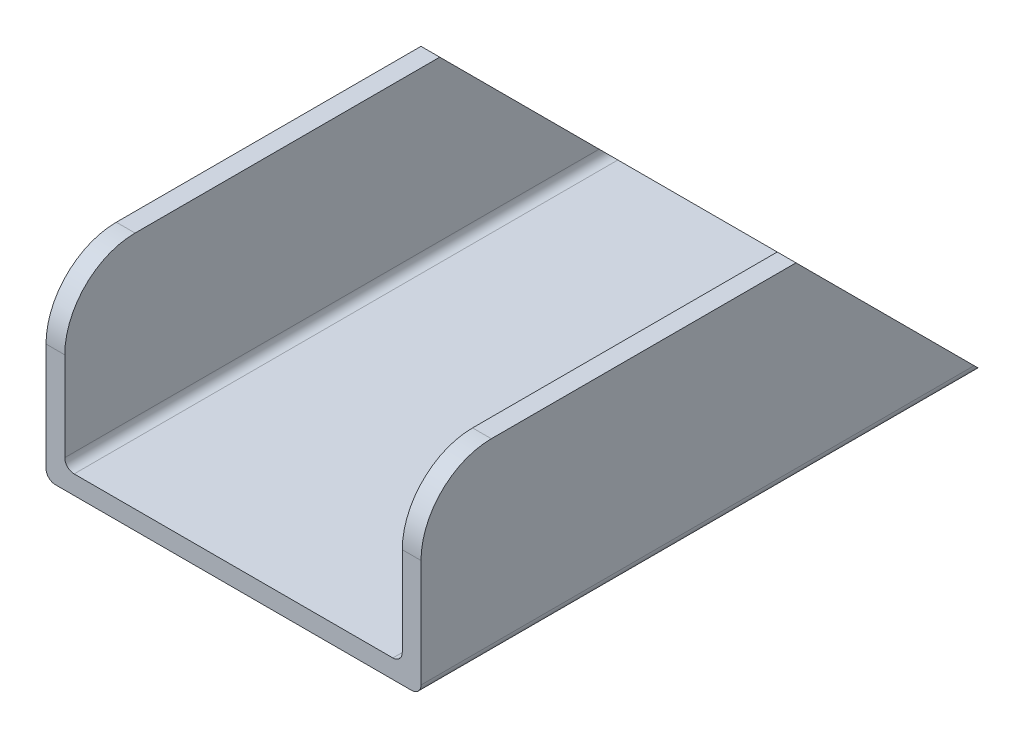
from build123d import *

# Parameters (mm, degrees)
BOSS_EXTRU_1_DEPTH           = 120
ENL_V_MAT_EXTRU_1_DEPTH      = 150.666295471
ENL_V_MAT_EXTRU_1_DEPTH_BACK = 150.666295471
CONG_1_R                     = 15


with BuildPart() as part:
    # Esquisse1 → Boss.-Extru.1 (new body)
    with BuildSketch(Plane.XY):
        with BuildLine():
            Line((-38, 0), (38, 0))
            ThreePointArc((38, 0), (39.414213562, 0.585786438), (40, 2))
            Line((40, 2), (40, 40))
            Line((40, 40), (36, 40))
            Line((36, 40), (36, 6))
            ThreePointArc((36, 6), (35.414213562, 4.585786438), (34, 4))
            Line((34, 4), (-34, 4))
            ThreePointArc((-34, 4), (-35.414213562, 4.585786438), (-36, 6))
            Line((-36, 6), (-36, 40))
            Line((-36, 40), (-40, 40))
            Line((-40, 40), (-40, 2))
            ThreePointArc((-40, 2), (-39.414213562, 0.585786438), (-38, 0))
        make_face()
    extrude(amount=BOSS_EXTRU_1_DEPTH)

    # Esquisse2 → Enl_v. mat.-Extru.1 (cut, two sides: drawn at the far end of the back side and taken through both)
    with BuildSketch(Plane.ZY.offset(40).offset(-ENL_V_MAT_EXTRU_1_DEPTH_BACK)):
        Polygon((-185.956506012, -185.956506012), (0, 0), (40, 40), (225.956506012, 225.956506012), (-145.956506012, 597.869518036), (-557.869518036, 185.956506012), align=None)
    extrude(amount=ENL_V_MAT_EXTRU_1_DEPTH + ENL_V_MAT_EXTRU_1_DEPTH_BACK, mode=Mode.SUBTRACT)

    # Cong_1
    cong_1_edges = [part.edges().sort_by_distance(p)[0] for p in [
        (-38, 40, 120),
        (38, 40, 120),
    ]]
    fillet(cong_1_edges, radius=CONG_1_R)


solid = part.part
